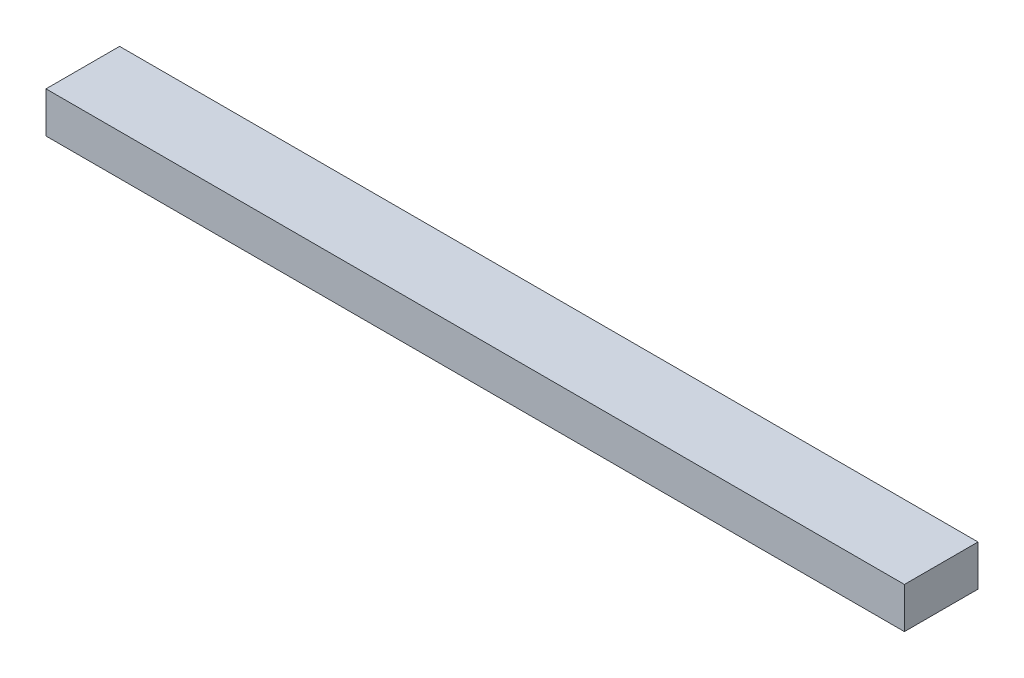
ISO-10303-21;
HEADER;
FILE_DESCRIPTION(('STEP AP214'),'2;1');
FILE_NAME('part.step','',(''),(''),'','','');
FILE_SCHEMA(('AUTOMOTIVE_DESIGN { 1 0 10303 214 1 1 1 1 }'));
ENDSEC;
DATA;
#1=APPLICATION_CONTEXT('core data for automotive mechanical design processes');
#2=APPLICATION_PROTOCOL_DEFINITION('international standard','automotive_design',2000,#1);
#3=PRODUCT_CONTEXT('',#1,'mechanical');
#4=PRODUCT('Part','Part','',(#3));
#5=PRODUCT_RELATED_PRODUCT_CATEGORY('part','',(#4));
#6=PRODUCT_DEFINITION_FORMATION('','',#4);
#7=PRODUCT_DEFINITION_CONTEXT('part definition',#1,'design');
#8=PRODUCT_DEFINITION('design','',#6,#7);
#9=PRODUCT_DEFINITION_SHAPE('','',#8);
#10=(LENGTH_UNIT() NAMED_UNIT(*) SI_UNIT(.MILLI.,.METRE.));
#11=(NAMED_UNIT(*) PLANE_ANGLE_UNIT() SI_UNIT($,.RADIAN.));
#12=(NAMED_UNIT(*) SI_UNIT($,.STERADIAN.) SOLID_ANGLE_UNIT());
#13=UNCERTAINTY_MEASURE_WITH_UNIT(LENGTH_MEASURE(1.E-05),#10,'distance_accuracy_value','');
#14=(GEOMETRIC_REPRESENTATION_CONTEXT(3) GLOBAL_UNCERTAINTY_ASSIGNED_CONTEXT((#13)) GLOBAL_UNIT_ASSIGNED_CONTEXT((#10,
#11,#12)) REPRESENTATION_CONTEXT('',''));
#15=CARTESIAN_POINT('',(0.,0.,0.));
#16=DIRECTION('',(0.,0.,1.));
#17=DIRECTION('',(1.,0.,0.));
#18=AXIS2_PLACEMENT_3D('',#15,#16,#17);
#19=CARTESIAN_POINT('',(0.,0.,-18.));
#20=DIRECTION('',(-1.,0.,0.));
#21=DIRECTION('',(0.,0.,1.));
#22=AXIS2_PLACEMENT_3D('',#19,#20,#21);
#23=PLANE('',#22);
#24=DIRECTION('',(0.,-1.,0.));
#25=VECTOR('',#24,1.);
#26=CARTESIAN_POINT('',(0.,0.,0.));
#27=LINE('',#26,#25);
#28=CARTESIAN_POINT('',(0.,10.,0.));
#29=VERTEX_POINT('',#28);
#30=CARTESIAN_POINT('',(0.,0.,0.));
#31=VERTEX_POINT('',#30);
#32=EDGE_CURVE('E66',#29,#31,#27,.T.);
#33=ORIENTED_EDGE('',*,*,#32,.F.);
#34=DIRECTION('',(0.,0.,1.));
#35=VECTOR('',#34,1.);
#36=CARTESIAN_POINT('',(0.,10.,-18.));
#37=LINE('',#36,#35);
#38=CARTESIAN_POINT('',(0.,10.,-18.));
#39=VERTEX_POINT('',#38);
#40=EDGE_CURVE('E11',#39,#29,#37,.T.);
#41=ORIENTED_EDGE('',*,*,#40,.F.);
#42=DIRECTION('',(0.,-1.,0.));
#43=VECTOR('',#42,1.);
#44=CARTESIAN_POINT('',(0.,0.,-18.));
#45=LINE('',#44,#43);
#46=CARTESIAN_POINT('',(0.,0.,-18.));
#47=VERTEX_POINT('',#46);
#48=EDGE_CURVE('E68',#39,#47,#45,.T.);
#49=ORIENTED_EDGE('',*,*,#48,.T.);
#50=DIRECTION('',(0.,0.,1.));
#51=VECTOR('',#50,1.);
#52=CARTESIAN_POINT('',(0.,0.,-18.));
#53=LINE('',#52,#51);
#54=EDGE_CURVE('E29',#47,#31,#53,.T.);
#55=ORIENTED_EDGE('',*,*,#54,.T.);
#56=EDGE_LOOP('',(#33,#41,#49,#55));
#57=FACE_BOUND('',#56,.T.);
#58=ADVANCED_FACE('F26',(#57),#23,.T.);
#59=CARTESIAN_POINT('',(0.,10.,-18.));
#60=DIRECTION('',(0.,1.,0.));
#61=DIRECTION('',(0.,0.,1.));
#62=AXIS2_PLACEMENT_3D('',#59,#60,#61);
#63=PLANE('',#62);
#64=DIRECTION('',(-1.,0.,0.));
#65=VECTOR('',#64,1.);
#66=CARTESIAN_POINT('',(0.,10.,0.));
#67=LINE('',#66,#65);
#68=CARTESIAN_POINT('',(210.,10.,0.));
#69=VERTEX_POINT('',#68);
#70=EDGE_CURVE('E83',#69,#29,#67,.T.);
#71=ORIENTED_EDGE('',*,*,#70,.F.);
#72=DIRECTION('',(0.,0.,1.));
#73=VECTOR('',#72,1.);
#74=CARTESIAN_POINT('',(210.,10.,-18.));
#75=LINE('',#74,#73);
#76=CARTESIAN_POINT('',(210.,10.,-18.));
#77=VERTEX_POINT('',#76);
#78=EDGE_CURVE('E34',#77,#69,#75,.T.);
#79=ORIENTED_EDGE('',*,*,#78,.F.);
#80=DIRECTION('',(-1.,0.,0.));
#81=VECTOR('',#80,1.);
#82=CARTESIAN_POINT('',(0.,10.,-18.));
#83=LINE('',#82,#81);
#84=EDGE_CURVE('E73',#77,#39,#83,.T.);
#85=ORIENTED_EDGE('',*,*,#84,.T.);
#86=ORIENTED_EDGE('',*,*,#40,.T.);
#87=EDGE_LOOP('',(#71,#79,#85,#86));
#88=FACE_BOUND('',#87,.T.);
#89=ADVANCED_FACE('F98',(#88),#63,.T.);
#90=CARTESIAN_POINT('',(210.,0.,-18.));
#91=DIRECTION('',(1.,0.,0.));
#92=DIRECTION('',(0.,0.,-1.));
#93=AXIS2_PLACEMENT_3D('',#90,#91,#92);
#94=PLANE('',#93);
#95=DIRECTION('',(0.,1.,0.));
#96=VECTOR('',#95,1.);
#97=CARTESIAN_POINT('',(210.,0.,0.));
#98=LINE('',#97,#96);
#99=CARTESIAN_POINT('',(210.,0.,0.));
#100=VERTEX_POINT('',#99);
#101=EDGE_CURVE('E80',#100,#69,#98,.T.);
#102=ORIENTED_EDGE('',*,*,#101,.F.);
#103=DIRECTION('',(0.,0.,1.));
#104=VECTOR('',#103,1.);
#105=CARTESIAN_POINT('',(210.,0.,-18.));
#106=LINE('',#105,#104);
#107=CARTESIAN_POINT('',(210.,0.,-18.));
#108=VERTEX_POINT('',#107);
#109=EDGE_CURVE('E72',#108,#100,#106,.T.);
#110=ORIENTED_EDGE('',*,*,#109,.F.);
#111=DIRECTION('',(0.,1.,0.));
#112=VECTOR('',#111,1.);
#113=CARTESIAN_POINT('',(210.,0.,-18.));
#114=LINE('',#113,#112);
#115=EDGE_CURVE('E91',#108,#77,#114,.T.);
#116=ORIENTED_EDGE('',*,*,#115,.T.);
#117=ORIENTED_EDGE('',*,*,#78,.T.);
#118=EDGE_LOOP('',(#102,#110,#116,#117));
#119=FACE_BOUND('',#118,.T.);
#120=ADVANCED_FACE('F95',(#119),#94,.T.);
#121=CARTESIAN_POINT('',(0.,0.,-18.));
#122=DIRECTION('',(0.,-1.,0.));
#123=DIRECTION('',(0.,0.,-1.));
#124=AXIS2_PLACEMENT_3D('',#121,#122,#123);
#125=PLANE('',#124);
#126=DIRECTION('',(1.,0.,0.));
#127=VECTOR('',#126,1.);
#128=CARTESIAN_POINT('',(0.,0.,0.));
#129=LINE('',#128,#127);
#130=EDGE_CURVE('E75',#31,#100,#129,.T.);
#131=ORIENTED_EDGE('',*,*,#130,.F.);
#132=ORIENTED_EDGE('',*,*,#54,.F.);
#133=DIRECTION('',(1.,0.,0.));
#134=VECTOR('',#133,1.);
#135=CARTESIAN_POINT('',(0.,0.,-18.));
#136=LINE('',#135,#134);
#137=EDGE_CURVE('E89',#47,#108,#136,.T.);
#138=ORIENTED_EDGE('',*,*,#137,.T.);
#139=ORIENTED_EDGE('',*,*,#109,.T.);
#140=EDGE_LOOP('',(#131,#132,#138,#139));
#141=FACE_BOUND('',#140,.T.);
#142=ADVANCED_FACE('F76',(#141),#125,.T.);
#143=CARTESIAN_POINT('',(0.,10.,-18.));
#144=DIRECTION('',(0.,0.,-1.));
#145=DIRECTION('',(-1.,0.,0.));
#146=AXIS2_PLACEMENT_3D('',#143,#144,#145);
#147=PLANE('',#146);
#148=ORIENTED_EDGE('',*,*,#48,.F.);
#149=ORIENTED_EDGE('',*,*,#84,.F.);
#150=ORIENTED_EDGE('',*,*,#115,.F.);
#151=ORIENTED_EDGE('',*,*,#137,.F.);
#152=EDGE_LOOP('',(#148,#149,#150,#151));
#153=FACE_BOUND('',#152,.T.);
#154=ADVANCED_FACE('F100',(#153),#147,.T.);
#155=CARTESIAN_POINT('',(0.,10.,0.));
#156=DIRECTION('',(0.,0.,-1.));
#157=DIRECTION('',(-1.,0.,0.));
#158=AXIS2_PLACEMENT_3D('',#155,#156,#157);
#159=PLANE('',#158);
#160=ORIENTED_EDGE('',*,*,#32,.T.);
#161=ORIENTED_EDGE('',*,*,#130,.T.);
#162=ORIENTED_EDGE('',*,*,#101,.T.);
#163=ORIENTED_EDGE('',*,*,#70,.T.);
#164=EDGE_LOOP('',(#160,#161,#162,#163));
#165=FACE_BOUND('',#164,.T.);
#166=ADVANCED_FACE('F82',(#165),#159,.F.);
#167=CLOSED_SHELL('',(#58,#89,#120,#142,#154,#166));
#168=MANIFOLD_SOLID_BREP('B2',#167);
#169=ADVANCED_BREP_SHAPE_REPRESENTATION('',(#18,#168),#14);
#170=SHAPE_DEFINITION_REPRESENTATION(#9,#169);
ENDSEC;
END-ISO-10303-21;
